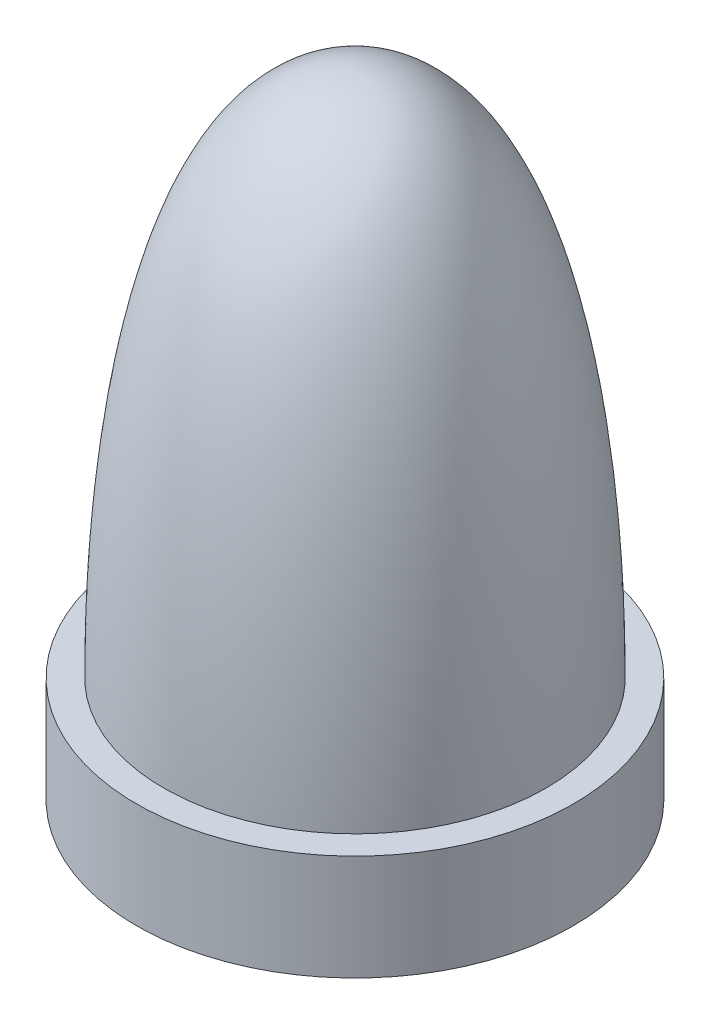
from build123d import *

# Parameters (mm, degrees)
TROU_TARAUD_M51_D     = 4.2
TROU_TARAUD_M51_DEPTH = 14
TROU_TARAUD_M51_TIP   = 1.212435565


with BuildPart() as part:
    # Esquisse1 → R_volution1 (revolve)
    with BuildSketch(Plane.XY, mode=Mode.PRIVATE) as r_volution1_sk:
        with BuildLine():
            Line((0, 0), (6, 0))
            Line((6, 0), (6, 2.9))
            Line((6, 2.9), (5.25, 2.9))
            add(Edge.make_bspline(
                [(0, 17.27), (4.175265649, 17.27), (5.25, 9.034018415), (5.25, 2.9)],
                knots=[0, 0, 0, 0, 1, 1, 1, 1], degree=3))
            Line((0, 17.27), (0, 0))
        make_face()
    revolve(r_volution1_sk.sketch.rotate(Axis((0, 0, 0), (0, 1, 0)), 90), axis=Axis((0, 0, 0), (0, 1, 0)))

    # Trou taraud_ M51
    with Locations(Plane(origin=(0, 0, 0), x_dir=(-1, 0, 0), z_dir=(0, -1, 0))):
        with Locations((0, 0)):
            Hole(TROU_TARAUD_M51_D / 2, depth=TROU_TARAUD_M51_DEPTH)
            with Locations((0, 0, -(TROU_TARAUD_M51_DEPTH + TROU_TARAUD_M51_TIP / 2))):  # 120° drill point
                Cone(0, TROU_TARAUD_M51_D / 2, TROU_TARAUD_M51_TIP, mode=Mode.SUBTRACT)


solid = part.part
